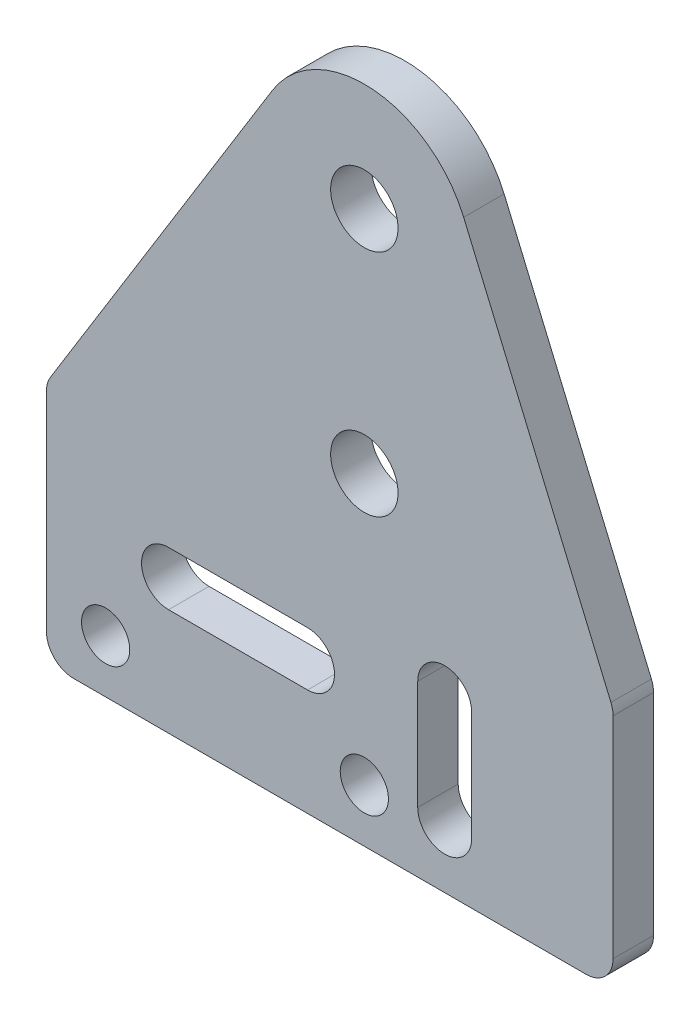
ISO-10303-21;
HEADER;
FILE_DESCRIPTION(('STEP AP214'),'2;1');
FILE_NAME('part.step','',(''),(''),'','','');
FILE_SCHEMA(('AUTOMOTIVE_DESIGN { 1 0 10303 214 1 1 1 1 }'));
ENDSEC;
DATA;
#1=APPLICATION_CONTEXT('core data for automotive mechanical design processes');
#2=APPLICATION_PROTOCOL_DEFINITION('international standard','automotive_design',2000,#1);
#3=PRODUCT_CONTEXT('',#1,'mechanical');
#4=PRODUCT('Part','Part','',(#3));
#5=PRODUCT_RELATED_PRODUCT_CATEGORY('part','',(#4));
#6=PRODUCT_DEFINITION_FORMATION('','',#4);
#7=PRODUCT_DEFINITION_CONTEXT('part definition',#1,'design');
#8=PRODUCT_DEFINITION('design','',#6,#7);
#9=PRODUCT_DEFINITION_SHAPE('','',#8);
#10=(LENGTH_UNIT() NAMED_UNIT(*) SI_UNIT(.MILLI.,.METRE.));
#11=(NAMED_UNIT(*) PLANE_ANGLE_UNIT() SI_UNIT($,.RADIAN.));
#12=(NAMED_UNIT(*) SI_UNIT($,.STERADIAN.) SOLID_ANGLE_UNIT());
#13=UNCERTAINTY_MEASURE_WITH_UNIT(LENGTH_MEASURE(1.E-05),#10,'distance_accuracy_value','');
#14=(GEOMETRIC_REPRESENTATION_CONTEXT(3) GLOBAL_UNCERTAINTY_ASSIGNED_CONTEXT((#13)) GLOBAL_UNIT_ASSIGNED_CONTEXT((#10,
#11,#12)) REPRESENTATION_CONTEXT('',''));
#15=CARTESIAN_POINT('',(0.,0.,0.));
#16=DIRECTION('',(0.,0.,1.));
#17=DIRECTION('',(1.,0.,0.));
#18=AXIS2_PLACEMENT_3D('',#15,#16,#17);
#19=CARTESIAN_POINT('',(16.4374999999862,198.39260540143,3.));
#20=DIRECTION('',(0.,0.,-1.));
#21=DIRECTION('',(-1.,0.,0.));
#22=AXIS2_PLACEMENT_3D('',#19,#20,#21);
#23=CYLINDRICAL_SURFACE('',#22,2.);
#24=CARTESIAN_POINT('',(16.4374999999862,198.39260540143,0.));
#25=DIRECTION('',(0.,0.,-1.));
#26=DIRECTION('',(-1.,0.,0.));
#27=AXIS2_PLACEMENT_3D('',#24,#25,#26);
#28=CIRCLE('',#27,2.);
#29=CARTESIAN_POINT('',(18.4374999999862,198.39260540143,0.));
#30=VERTEX_POINT('',#29);
#31=CARTESIAN_POINT('',(18.2781418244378,199.1749337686,0.));
#32=VERTEX_POINT('',#31);
#33=EDGE_CURVE('E156',#30,#32,#28,.F.);
#34=ORIENTED_EDGE('',*,*,#33,.T.);
#35=DIRECTION('',(0.,0.,1.));
#36=VECTOR('',#35,1.);
#37=CARTESIAN_POINT('',(18.2781418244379,199.1749337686,3.));
#38=LINE('',#37,#36);
#39=CARTESIAN_POINT('',(18.2781418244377,199.1749337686,3.));
#40=VERTEX_POINT('',#39);
#41=EDGE_CURVE('E146',#32,#40,#38,.T.);
#42=ORIENTED_EDGE('',*,*,#41,.T.);
#43=CARTESIAN_POINT('',(16.4374999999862,198.39260540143,3.));
#44=DIRECTION('',(0.,0.,-1.));
#45=DIRECTION('',(-1.,0.,0.));
#46=AXIS2_PLACEMENT_3D('',#43,#44,#45);
#47=CIRCLE('',#46,2.);
#48=CARTESIAN_POINT('',(18.4374999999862,198.39260540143,3.));
#49=VERTEX_POINT('',#48);
#50=EDGE_CURVE('E20',#40,#49,#47,.T.);
#51=ORIENTED_EDGE('',*,*,#50,.T.);
#52=DIRECTION('',(0.,0.,1.));
#53=VECTOR('',#52,1.);
#54=CARTESIAN_POINT('',(18.4374999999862,198.39260540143,3.));
#55=LINE('',#54,#53);
#56=EDGE_CURVE('E143',#49,#30,#55,.F.);
#57=ORIENTED_EDGE('',*,*,#56,.T.);
#58=EDGE_LOOP('',(#34,#42,#51,#57));
#59=FACE_BOUND('',#58,.T.);
#60=ADVANCED_FACE('F17',(#59),#23,.T.);
#61=CARTESIAN_POINT('',(-21.5625000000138,198.232188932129,3.));
#62=DIRECTION('',(0.,0.,-1.));
#63=DIRECTION('',(-1.,0.,0.));
#64=AXIS2_PLACEMENT_3D('',#61,#62,#63);
#65=CYLINDRICAL_SURFACE('',#64,2.);
#66=CARTESIAN_POINT('',(-21.5625000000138,198.232188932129,0.));
#67=DIRECTION('',(0.,0.,-1.));
#68=DIRECTION('',(-1.,0.,0.));
#69=AXIS2_PLACEMENT_3D('',#66,#67,#68);
#70=CIRCLE('',#69,2.);
#71=CARTESIAN_POINT('',(-23.2641391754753,199.283104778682,0.));
#72=VERTEX_POINT('',#71);
#73=CARTESIAN_POINT('',(-23.5625000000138,198.232188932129,0.));
#74=VERTEX_POINT('',#73);
#75=EDGE_CURVE('E292',#72,#74,#70,.F.);
#76=ORIENTED_EDGE('',*,*,#75,.T.);
#77=DIRECTION('',(0.,0.,-1.));
#78=VECTOR('',#77,1.);
#79=CARTESIAN_POINT('',(-23.5625000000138,198.232188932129,3.));
#80=LINE('',#79,#78);
#81=CARTESIAN_POINT('',(-23.5625000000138,198.232188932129,3.));
#82=VERTEX_POINT('',#81);
#83=EDGE_CURVE('E210',#74,#82,#80,.F.);
#84=ORIENTED_EDGE('',*,*,#83,.T.);
#85=CARTESIAN_POINT('',(-21.5625000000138,198.232188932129,3.));
#86=DIRECTION('',(0.,0.,-1.));
#87=DIRECTION('',(-1.,0.,0.));
#88=AXIS2_PLACEMENT_3D('',#85,#86,#87);
#89=CIRCLE('',#88,2.);
#90=CARTESIAN_POINT('',(-23.2641391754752,199.283104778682,3.));
#91=VERTEX_POINT('',#90);
#92=EDGE_CURVE('E148',#82,#91,#89,.T.);
#93=ORIENTED_EDGE('',*,*,#92,.T.);
#94=DIRECTION('',(0.,0.,1.));
#95=VECTOR('',#94,1.);
#96=CARTESIAN_POINT('',(-23.2641391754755,199.283104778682,3.));
#97=LINE('',#96,#95);
#98=EDGE_CURVE('E216',#91,#72,#97,.F.);
#99=ORIENTED_EDGE('',*,*,#98,.T.);
#100=EDGE_LOOP('',(#76,#84,#93,#99));
#101=FACE_BOUND('',#100,.T.);
#102=ADVANCED_FACE('F295',(#101),#65,.T.);
#103=CARTESIAN_POINT('',(0.,221.727500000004,0.));
#104=DIRECTION('',(0.,0.,1.));
#105=DIRECTION('',(1.,0.,0.));
#106=AXIS2_PLACEMENT_3D('',#103,#104,#105);
#107=PLANE('',#106);
#108=DIRECTION('',(1.,0.,0.));
#109=VECTOR('',#108,1.);
#110=CARTESIAN_POINT('',(0.,188.730000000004,0.));
#111=LINE('',#110,#109);
#112=CARTESIAN_POINT('',(-4.21250000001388,188.730000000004,0.));
#113=VERTEX_POINT('',#112);
#114=CARTESIAN_POINT('',(-14.5125000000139,188.730000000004,0.));
#115=VERTEX_POINT('',#114);
#116=EDGE_CURVE('E181',#113,#115,#111,.F.);
#117=ORIENTED_EDGE('',*,*,#116,.F.);
#118=CARTESIAN_POINT('',(-4.21250000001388,190.730000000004,0.));
#119=DIRECTION('',(0.,0.,1.));
#120=DIRECTION('',(1.,0.,0.));
#121=AXIS2_PLACEMENT_3D('',#118,#119,#120);
#122=CIRCLE('',#121,2.);
#123=CARTESIAN_POINT('',(-4.21250000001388,192.730000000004,0.));
#124=VERTEX_POINT('',#123);
#125=EDGE_CURVE('E164',#113,#124,#122,.T.);
#126=ORIENTED_EDGE('',*,*,#125,.T.);
#127=DIRECTION('',(1.,0.,0.));
#128=VECTOR('',#127,1.);
#129=CARTESIAN_POINT('',(0.,192.730000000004,0.));
#130=LINE('',#129,#128);
#131=CARTESIAN_POINT('',(-14.5125000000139,192.730000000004,0.));
#132=VERTEX_POINT('',#131);
#133=EDGE_CURVE('E177',#124,#132,#130,.F.);
#134=ORIENTED_EDGE('',*,*,#133,.T.);
#135=CARTESIAN_POINT('',(-14.5125000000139,190.730000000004,0.));
#136=DIRECTION('',(0.,0.,1.));
#137=DIRECTION('',(1.,0.,0.));
#138=AXIS2_PLACEMENT_3D('',#135,#136,#137);
#139=CIRCLE('',#138,2.);
#140=EDGE_CURVE('E180',#132,#115,#139,.T.);
#141=ORIENTED_EDGE('',*,*,#140,.T.);
#142=EDGE_LOOP('',(#117,#126,#134,#141));
#143=FACE_BOUND('',#142,.T.);
#144=CARTESIAN_POINT('',(0.,204.727500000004,0.));
#145=DIRECTION('',(0.,0.,-1.));
#146=DIRECTION('',(-1.,0.,0.));
#147=AXIS2_PLACEMENT_3D('',#144,#145,#146);
#148=CIRCLE('',#147,2.5);
#149=CARTESIAN_POINT('',(-2.5,204.727500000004,0.));
#150=VERTEX_POINT('',#149);
#151=EDGE_CURVE('E227',#150,#150,#148,.F.);
#152=ORIENTED_EDGE('',*,*,#151,.T.);
#153=EDGE_LOOP('',(#152));
#154=FACE_BOUND('',#153,.T.);
#155=CARTESIAN_POINT('',(0.,221.727500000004,0.));
#156=DIRECTION('',(0.,0.,-1.));
#157=DIRECTION('',(-1.,0.,0.));
#158=AXIS2_PLACEMENT_3D('',#155,#156,#157);
#159=CIRCLE('',#158,2.5);
#160=CARTESIAN_POINT('',(-2.5,221.727500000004,0.));
#161=VERTEX_POINT('',#160);
#162=EDGE_CURVE('E197',#161,#161,#159,.F.);
#163=ORIENTED_EDGE('',*,*,#162,.T.);
#164=EDGE_LOOP('',(#163));
#165=FACE_BOUND('',#164,.T.);
#166=CARTESIAN_POINT('',(-1.38487311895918E-11,184.727500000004,0.));
#167=DIRECTION('',(0.,0.,-1.));
#168=DIRECTION('',(-1.,0.,0.));
#169=AXIS2_PLACEMENT_3D('',#166,#167,#168);
#170=CIRCLE('',#169,1.7875);
#171=CARTESIAN_POINT('',(-1.78750000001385,184.727500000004,0.));
#172=VERTEX_POINT('',#171);
#173=EDGE_CURVE('E279',#172,#172,#170,.F.);
#174=ORIENTED_EDGE('',*,*,#173,.T.);
#175=EDGE_LOOP('',(#174));
#176=FACE_BOUND('',#175,.T.);
#177=CARTESIAN_POINT('',(-19.1750000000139,184.727500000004,0.));
#178=DIRECTION('',(0.,0.,-1.));
#179=DIRECTION('',(-1.,0.,0.));
#180=AXIS2_PLACEMENT_3D('',#177,#178,#179);
#181=CIRCLE('',#180,1.7875);
#182=CARTESIAN_POINT('',(-20.9625000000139,184.727500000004,0.));
#183=VERTEX_POINT('',#182);
#184=EDGE_CURVE('E282',#183,#183,#181,.F.);
#185=ORIENTED_EDGE('',*,*,#184,.T.);
#186=EDGE_LOOP('',(#185));
#187=FACE_BOUND('',#186,.T.);
#188=DIRECTION('',(0.,1.,0.));
#189=VECTOR('',#188,1.);
#190=CARTESIAN_POINT('',(3.95749999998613,0.,0.));
#191=LINE('',#190,#189);
#192=CARTESIAN_POINT('',(3.95749999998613,185.275000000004,0.));
#193=VERTEX_POINT('',#192);
#194=CARTESIAN_POINT('',(3.95749999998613,193.375000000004,0.));
#195=VERTEX_POINT('',#194);
#196=EDGE_CURVE('E194',#193,#195,#191,.T.);
#197=ORIENTED_EDGE('',*,*,#196,.F.);
#198=CARTESIAN_POINT('',(5.95749999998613,185.275000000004,0.));
#199=DIRECTION('',(0.,0.,1.));
#200=DIRECTION('',(1.,0.,0.));
#201=AXIS2_PLACEMENT_3D('',#198,#199,#200);
#202=CIRCLE('',#201,2.);
#203=CARTESIAN_POINT('',(7.95749999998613,185.275000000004,0.));
#204=VERTEX_POINT('',#203);
#205=EDGE_CURVE('E188',#193,#204,#202,.T.);
#206=ORIENTED_EDGE('',*,*,#205,.T.);
#207=DIRECTION('',(0.,1.,0.));
#208=VECTOR('',#207,1.);
#209=CARTESIAN_POINT('',(7.95749999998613,0.,0.));
#210=LINE('',#209,#208);
#211=CARTESIAN_POINT('',(7.95749999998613,193.375000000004,0.));
#212=VERTEX_POINT('',#211);
#213=EDGE_CURVE('E190',#204,#212,#210,.T.);
#214=ORIENTED_EDGE('',*,*,#213,.T.);
#215=CARTESIAN_POINT('',(5.95749999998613,193.375000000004,0.));
#216=DIRECTION('',(0.,0.,1.));
#217=DIRECTION('',(1.,0.,0.));
#218=AXIS2_PLACEMENT_3D('',#215,#216,#217);
#219=CIRCLE('',#218,2.);
#220=EDGE_CURVE('E193',#212,#195,#219,.T.);
#221=ORIENTED_EDGE('',*,*,#220,.T.);
#222=EDGE_LOOP('',(#197,#206,#214,#221));
#223=FACE_BOUND('',#222,.T.);
#224=ORIENTED_EDGE('',*,*,#33,.F.);
#225=DIRECTION('',(0.,1.,0.));
#226=VECTOR('',#225,1.);
#227=CARTESIAN_POINT('',(18.4374999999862,198.800000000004,0.));
#228=LINE('',#227,#226);
#229=CARTESIAN_POINT('',(18.4374999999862,182.800000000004,0.));
#230=VERTEX_POINT('',#229);
#231=EDGE_CURVE('E155',#30,#230,#228,.F.);
#232=ORIENTED_EDGE('',*,*,#231,.T.);
#233=CARTESIAN_POINT('',(16.4374999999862,182.800000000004,0.));
#234=DIRECTION('',(0.,0.,-1.));
#235=DIRECTION('',(-1.,0.,0.));
#236=AXIS2_PLACEMENT_3D('',#233,#234,#235);
#237=CIRCLE('',#236,2.);
#238=CARTESIAN_POINT('',(16.4374999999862,180.800000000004,0.));
#239=VERTEX_POINT('',#238);
#240=EDGE_CURVE('E198',#239,#230,#237,.F.);
#241=ORIENTED_EDGE('',*,*,#240,.F.);
#242=DIRECTION('',(1.,0.,0.));
#243=VECTOR('',#242,1.);
#244=CARTESIAN_POINT('',(-23.5625000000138,180.800000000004,0.));
#245=LINE('',#244,#243);
#246=CARTESIAN_POINT('',(-21.5625000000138,180.800000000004,0.));
#247=VERTEX_POINT('',#246);
#248=EDGE_CURVE('E202',#239,#247,#245,.F.);
#249=ORIENTED_EDGE('',*,*,#248,.T.);
#250=CARTESIAN_POINT('',(-21.5625000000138,182.800000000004,0.));
#251=DIRECTION('',(0.,0.,-1.));
#252=DIRECTION('',(-1.,0.,0.));
#253=AXIS2_PLACEMENT_3D('',#250,#251,#252);
#254=CIRCLE('',#253,2.);
#255=CARTESIAN_POINT('',(-23.5625000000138,182.800000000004,0.));
#256=VERTEX_POINT('',#255);
#257=EDGE_CURVE('E205',#256,#247,#254,.F.);
#258=ORIENTED_EDGE('',*,*,#257,.F.);
#259=DIRECTION('',(0.,1.,0.));
#260=VECTOR('',#259,1.);
#261=CARTESIAN_POINT('',(-23.5625000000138,198.800000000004,0.));
#262=LINE('',#261,#260);
#263=EDGE_CURVE('E209',#256,#74,#262,.T.);
#264=ORIENTED_EDGE('',*,*,#263,.T.);
#265=ORIENTED_EDGE('',*,*,#75,.F.);
#266=DIRECTION('',(0.525457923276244,0.850819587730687,0.));
#267=VECTOR('',#266,1.);
#268=CARTESIAN_POINT('',(-6.80655670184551,225.931163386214,0.));
#269=LINE('',#268,#267);
#270=CARTESIAN_POINT('',(-6.80655670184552,225.931163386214,0.));
#271=VERTEX_POINT('',#270);
#272=EDGE_CURVE('E213',#72,#271,#269,.T.);
#273=ORIENTED_EDGE('',*,*,#272,.T.);
#274=CARTESIAN_POINT('',(0.,221.727500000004,0.));
#275=DIRECTION('',(0.,0.,-1.));
#276=DIRECTION('',(-1.,0.,0.));
#277=AXIS2_PLACEMENT_3D('',#274,#275,#276);
#278=CIRCLE('',#277,8.);
#279=CARTESIAN_POINT('',(7.36256729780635,224.856813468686,0.));
#280=VERTEX_POINT('',#279);
#281=EDGE_CURVE('E221',#280,#271,#278,.F.);
#282=ORIENTED_EDGE('',*,*,#281,.F.);
#283=DIRECTION('',(0.391164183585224,-0.920320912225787,0.));
#284=VECTOR('',#283,1.);
#285=CARTESIAN_POINT('',(18.4374999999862,198.800000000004,0.));
#286=LINE('',#285,#284);
#287=EDGE_CURVE('E222',#280,#32,#286,.T.);
#288=ORIENTED_EDGE('',*,*,#287,.T.);
#289=EDGE_LOOP('',(#224,#232,#241,#249,#258,#264,#265,#273,#282,#288));
#290=FACE_BOUND('',#289,.T.);
#291=ADVANCED_FACE('F328',(#143,#154,#165,#176,#187,#223,#290),#107,.F.);
#292=CARTESIAN_POINT('',(18.4374999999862,198.800000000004,3.));
#293=DIRECTION('',(-1.,0.,0.));
#294=DIRECTION('',(0.,0.,1.));
#295=AXIS2_PLACEMENT_3D('',#292,#293,#294);
#296=PLANE('',#295);
#297=ORIENTED_EDGE('',*,*,#56,.F.);
#298=DIRECTION('',(0.,1.,0.));
#299=VECTOR('',#298,1.);
#300=CARTESIAN_POINT('',(18.4374999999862,221.727500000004,3.));
#301=LINE('',#300,#299);
#302=CARTESIAN_POINT('',(18.4374999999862,182.800000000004,3.));
#303=VERTEX_POINT('',#302);
#304=EDGE_CURVE('E153',#303,#49,#301,.T.);
#305=ORIENTED_EDGE('',*,*,#304,.F.);
#306=DIRECTION('',(0.,0.,-1.));
#307=VECTOR('',#306,1.);
#308=CARTESIAN_POINT('',(18.4374999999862,182.800000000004,3.));
#309=LINE('',#308,#307);
#310=EDGE_CURVE('E195',#230,#303,#309,.F.);
#311=ORIENTED_EDGE('',*,*,#310,.F.);
#312=ORIENTED_EDGE('',*,*,#231,.F.);
#313=EDGE_LOOP('',(#297,#305,#311,#312));
#314=FACE_BOUND('',#313,.T.);
#315=ADVANCED_FACE('F151',(#314),#296,.F.);
#316=CARTESIAN_POINT('',(18.4374999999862,198.800000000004,3.));
#317=DIRECTION('',(-0.920320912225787,-0.391164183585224,0.));
#318=DIRECTION('',(0.391164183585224,-0.920320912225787,0.));
#319=AXIS2_PLACEMENT_3D('',#316,#317,#318);
#320=PLANE('',#319);
#321=ORIENTED_EDGE('',*,*,#41,.F.);
#322=ORIENTED_EDGE('',*,*,#287,.F.);
#323=DIRECTION('',(0.,0.,-1.));
#324=VECTOR('',#323,1.);
#325=CARTESIAN_POINT('',(7.36256729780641,224.856813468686,3.));
#326=LINE('',#325,#324);
#327=CARTESIAN_POINT('',(7.36256729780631,224.856813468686,3.));
#328=VERTEX_POINT('',#327);
#329=EDGE_CURVE('E217',#328,#280,#326,.T.);
#330=ORIENTED_EDGE('',*,*,#329,.F.);
#331=DIRECTION('',(-0.391164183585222,0.920320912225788,0.));
#332=VECTOR('',#331,1.);
#333=CARTESIAN_POINT('',(18.2781418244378,199.174933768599,3.));
#334=LINE('',#333,#332);
#335=EDGE_CURVE('E163',#40,#328,#334,.T.);
#336=ORIENTED_EDGE('',*,*,#335,.F.);
#337=EDGE_LOOP('',(#321,#322,#330,#336));
#338=FACE_BOUND('',#337,.T.);
#339=ADVANCED_FACE('F506',(#338),#320,.F.);
#340=CARTESIAN_POINT('',(0.,221.727500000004,3.));
#341=DIRECTION('',(0.,0.,-1.));
#342=DIRECTION('',(-1.,0.,0.));
#343=AXIS2_PLACEMENT_3D('',#340,#341,#342);
#344=CYLINDRICAL_SURFACE('',#343,8.);
#345=CARTESIAN_POINT('',(0.,221.727500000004,3.));
#346=DIRECTION('',(0.,0.,-1.));
#347=DIRECTION('',(-1.,0.,0.));
#348=AXIS2_PLACEMENT_3D('',#345,#346,#347);
#349=CIRCLE('',#348,8.);
#350=CARTESIAN_POINT('',(-6.80655670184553,225.931163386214,3.));
#351=VERTEX_POINT('',#350);
#352=EDGE_CURVE('E166',#328,#351,#349,.F.);
#353=ORIENTED_EDGE('',*,*,#352,.F.);
#354=ORIENTED_EDGE('',*,*,#329,.T.);
#355=ORIENTED_EDGE('',*,*,#281,.T.);
#356=DIRECTION('',(0.,0.,1.));
#357=VECTOR('',#356,1.);
#358=CARTESIAN_POINT('',(-6.80655670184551,225.931163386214,3.));
#359=LINE('',#358,#357);
#360=EDGE_CURVE('E214',#271,#351,#359,.T.);
#361=ORIENTED_EDGE('',*,*,#360,.T.);
#362=EDGE_LOOP('',(#353,#354,#355,#361));
#363=FACE_BOUND('',#362,.T.);
#364=ADVANCED_FACE('F498',(#363),#344,.T.);
#365=CARTESIAN_POINT('',(-6.80655670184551,225.931163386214,3.));
#366=DIRECTION('',(0.850819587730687,-0.525457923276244,0.));
#367=DIRECTION('',(0.525457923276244,0.850819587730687,0.));
#368=AXIS2_PLACEMENT_3D('',#365,#366,#367);
#369=PLANE('',#368);
#370=ORIENTED_EDGE('',*,*,#98,.F.);
#371=DIRECTION('',(-0.525457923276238,-0.850819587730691,0.));
#372=VECTOR('',#371,1.);
#373=CARTESIAN_POINT('',(-6.8065567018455,225.931163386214,3.));
#374=LINE('',#373,#372);
#375=EDGE_CURVE('E269',#351,#91,#374,.T.);
#376=ORIENTED_EDGE('',*,*,#375,.F.);
#377=ORIENTED_EDGE('',*,*,#360,.F.);
#378=ORIENTED_EDGE('',*,*,#272,.F.);
#379=EDGE_LOOP('',(#370,#376,#377,#378));
#380=FACE_BOUND('',#379,.T.);
#381=ADVANCED_FACE('F304',(#380),#369,.F.);
#382=CARTESIAN_POINT('',(-23.5625000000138,198.800000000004,3.));
#383=DIRECTION('',(1.,0.,0.));
#384=DIRECTION('',(0.,0.,-1.));
#385=AXIS2_PLACEMENT_3D('',#382,#383,#384);
#386=PLANE('',#385);
#387=DIRECTION('',(0.,0.,-1.));
#388=VECTOR('',#387,1.);
#389=CARTESIAN_POINT('',(-23.5625000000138,182.800000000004,3.));
#390=LINE('',#389,#388);
#391=CARTESIAN_POINT('',(-23.5625000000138,182.800000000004,3.));
#392=VERTEX_POINT('',#391);
#393=EDGE_CURVE('E206',#392,#256,#390,.T.);
#394=ORIENTED_EDGE('',*,*,#393,.F.);
#395=DIRECTION('',(0.,1.,0.));
#396=VECTOR('',#395,1.);
#397=CARTESIAN_POINT('',(-23.5625000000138,221.727500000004,3.));
#398=LINE('',#397,#396);
#399=EDGE_CURVE('E267',#82,#392,#398,.F.);
#400=ORIENTED_EDGE('',*,*,#399,.F.);
#401=ORIENTED_EDGE('',*,*,#83,.F.);
#402=ORIENTED_EDGE('',*,*,#263,.F.);
#403=EDGE_LOOP('',(#394,#400,#401,#402));
#404=FACE_BOUND('',#403,.T.);
#405=ADVANCED_FACE('F481',(#404),#386,.F.);
#406=CARTESIAN_POINT('',(-21.5625000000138,182.800000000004,3.));
#407=DIRECTION('',(0.,0.,-1.));
#408=DIRECTION('',(-1.,0.,0.));
#409=AXIS2_PLACEMENT_3D('',#406,#407,#408);
#410=CYLINDRICAL_SURFACE('',#409,2.);
#411=ORIENTED_EDGE('',*,*,#257,.T.);
#412=DIRECTION('',(0.,0.,1.));
#413=VECTOR('',#412,1.);
#414=CARTESIAN_POINT('',(-21.5625000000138,180.800000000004,3.));
#415=LINE('',#414,#413);
#416=CARTESIAN_POINT('',(-21.5625000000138,180.800000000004,3.));
#417=VERTEX_POINT('',#416);
#418=EDGE_CURVE('E203',#247,#417,#415,.T.);
#419=ORIENTED_EDGE('',*,*,#418,.T.);
#420=CARTESIAN_POINT('',(-21.5625000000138,182.800000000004,3.));
#421=DIRECTION('',(0.,0.,-1.));
#422=DIRECTION('',(-1.,0.,0.));
#423=AXIS2_PLACEMENT_3D('',#420,#421,#422);
#424=CIRCLE('',#423,2.);
#425=EDGE_CURVE('E264',#392,#417,#424,.F.);
#426=ORIENTED_EDGE('',*,*,#425,.F.);
#427=ORIENTED_EDGE('',*,*,#393,.T.);
#428=EDGE_LOOP('',(#411,#419,#426,#427));
#429=FACE_BOUND('',#428,.T.);
#430=ADVANCED_FACE('F472',(#429),#410,.T.);
#431=CARTESIAN_POINT('',(-23.5625000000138,180.800000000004,3.));
#432=DIRECTION('',(0.,1.,0.));
#433=DIRECTION('',(0.,0.,1.));
#434=AXIS2_PLACEMENT_3D('',#431,#432,#433);
#435=PLANE('',#434);
#436=DIRECTION('',(0.,0.,-1.));
#437=VECTOR('',#436,1.);
#438=CARTESIAN_POINT('',(16.4374999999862,180.800000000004,3.));
#439=LINE('',#438,#437);
#440=CARTESIAN_POINT('',(16.4374999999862,180.800000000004,3.));
#441=VERTEX_POINT('',#440);
#442=EDGE_CURVE('E199',#441,#239,#439,.T.);
#443=ORIENTED_EDGE('',*,*,#442,.F.);
#444=DIRECTION('',(1.,0.,0.));
#445=VECTOR('',#444,1.);
#446=CARTESIAN_POINT('',(0.,180.800000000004,3.));
#447=LINE('',#446,#445);
#448=EDGE_CURVE('E263',#417,#441,#447,.T.);
#449=ORIENTED_EDGE('',*,*,#448,.F.);
#450=ORIENTED_EDGE('',*,*,#418,.F.);
#451=ORIENTED_EDGE('',*,*,#248,.F.);
#452=EDGE_LOOP('',(#443,#449,#450,#451));
#453=FACE_BOUND('',#452,.T.);
#454=ADVANCED_FACE('F463',(#453),#435,.F.);
#455=CARTESIAN_POINT('',(16.4374999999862,182.800000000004,3.));
#456=DIRECTION('',(0.,0.,-1.));
#457=DIRECTION('',(-1.,0.,0.));
#458=AXIS2_PLACEMENT_3D('',#455,#456,#457);
#459=CYLINDRICAL_SURFACE('',#458,2.);
#460=ORIENTED_EDGE('',*,*,#240,.T.);
#461=ORIENTED_EDGE('',*,*,#310,.T.);
#462=CARTESIAN_POINT('',(16.4374999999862,182.800000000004,3.));
#463=DIRECTION('',(0.,0.,-1.));
#464=DIRECTION('',(-1.,0.,0.));
#465=AXIS2_PLACEMENT_3D('',#462,#463,#464);
#466=CIRCLE('',#465,2.);
#467=EDGE_CURVE('E162',#441,#303,#466,.F.);
#468=ORIENTED_EDGE('',*,*,#467,.F.);
#469=ORIENTED_EDGE('',*,*,#442,.T.);
#470=EDGE_LOOP('',(#460,#461,#468,#469));
#471=FACE_BOUND('',#470,.T.);
#472=ADVANCED_FACE('F454',(#471),#459,.T.);
#473=CARTESIAN_POINT('',(0.,221.727500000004,3.));
#474=DIRECTION('',(0.,0.,-1.));
#475=DIRECTION('',(-1.,0.,0.));
#476=AXIS2_PLACEMENT_3D('',#473,#474,#475);
#477=CYLINDRICAL_SURFACE('',#476,2.5);
#478=CARTESIAN_POINT('',(0.,221.727500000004,3.));
#479=DIRECTION('',(0.,0.,-1.));
#480=DIRECTION('',(-1.,0.,0.));
#481=AXIS2_PLACEMENT_3D('',#478,#479,#480);
#482=CIRCLE('',#481,2.5);
#483=CARTESIAN_POINT('',(-2.5,221.727500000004,3.));
#484=VERTEX_POINT('',#483);
#485=EDGE_CURVE('E259',#484,#484,#482,.T.);
#486=ORIENTED_EDGE('',*,*,#485,.F.);
#487=EDGE_LOOP('',(#486));
#488=FACE_BOUND('',#487,.T.);
#489=ORIENTED_EDGE('',*,*,#162,.F.);
#490=EDGE_LOOP('',(#489));
#491=FACE_BOUND('',#490,.T.);
#492=ADVANCED_FACE('F445',(#488,#491),#477,.F.);
#493=CARTESIAN_POINT('',(-19.1750000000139,184.727500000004,3.));
#494=DIRECTION('',(0.,0.,-1.));
#495=DIRECTION('',(-1.,0.,0.));
#496=AXIS2_PLACEMENT_3D('',#493,#494,#495);
#497=CYLINDRICAL_SURFACE('',#496,1.7875);
#498=CARTESIAN_POINT('',(-19.1750000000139,184.727500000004,3.));
#499=DIRECTION('',(0.,0.,-1.));
#500=DIRECTION('',(-1.,0.,0.));
#501=AXIS2_PLACEMENT_3D('',#498,#499,#500);
#502=CIRCLE('',#501,1.7875);
#503=CARTESIAN_POINT('',(-20.9625000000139,184.727500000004,3.));
#504=VERTEX_POINT('',#503);
#505=EDGE_CURVE('E256',#504,#504,#502,.T.);
#506=ORIENTED_EDGE('',*,*,#505,.F.);
#507=EDGE_LOOP('',(#506));
#508=FACE_BOUND('',#507,.T.);
#509=ORIENTED_EDGE('',*,*,#184,.F.);
#510=EDGE_LOOP('',(#509));
#511=FACE_BOUND('',#510,.T.);
#512=ADVANCED_FACE('F436',(#508,#511),#497,.F.);
#513=CARTESIAN_POINT('',(-1.38487311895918E-11,184.727500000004,3.));
#514=DIRECTION('',(0.,0.,-1.));
#515=DIRECTION('',(-1.,0.,0.));
#516=AXIS2_PLACEMENT_3D('',#513,#514,#515);
#517=CYLINDRICAL_SURFACE('',#516,1.7875);
#518=CARTESIAN_POINT('',(-1.38487311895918E-11,184.727500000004,3.));
#519=DIRECTION('',(0.,0.,-1.));
#520=DIRECTION('',(-1.,0.,0.));
#521=AXIS2_PLACEMENT_3D('',#518,#519,#520);
#522=CIRCLE('',#521,1.7875);
#523=CARTESIAN_POINT('',(-1.78750000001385,184.727500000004,3.));
#524=VERTEX_POINT('',#523);
#525=EDGE_CURVE('E253',#524,#524,#522,.T.);
#526=ORIENTED_EDGE('',*,*,#525,.F.);
#527=EDGE_LOOP('',(#526));
#528=FACE_BOUND('',#527,.T.);
#529=ORIENTED_EDGE('',*,*,#173,.F.);
#530=EDGE_LOOP('',(#529));
#531=FACE_BOUND('',#530,.T.);
#532=ADVANCED_FACE('F427',(#528,#531),#517,.F.);
#533=CARTESIAN_POINT('',(0.,204.727500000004,3.));
#534=DIRECTION('',(0.,0.,-1.));
#535=DIRECTION('',(-1.,0.,0.));
#536=AXIS2_PLACEMENT_3D('',#533,#534,#535);
#537=CYLINDRICAL_SURFACE('',#536,2.5);
#538=CARTESIAN_POINT('',(0.,204.727500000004,3.));
#539=DIRECTION('',(0.,0.,-1.));
#540=DIRECTION('',(-1.,0.,0.));
#541=AXIS2_PLACEMENT_3D('',#538,#539,#540);
#542=CIRCLE('',#541,2.5);
#543=CARTESIAN_POINT('',(-2.5,204.727500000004,3.));
#544=VERTEX_POINT('',#543);
#545=EDGE_CURVE('E250',#544,#544,#542,.T.);
#546=ORIENTED_EDGE('',*,*,#545,.F.);
#547=EDGE_LOOP('',(#546));
#548=FACE_BOUND('',#547,.T.);
#549=ORIENTED_EDGE('',*,*,#151,.F.);
#550=EDGE_LOOP('',(#549));
#551=FACE_BOUND('',#550,.T.);
#552=ADVANCED_FACE('F418',(#548,#551),#537,.F.);
#553=CARTESIAN_POINT('',(3.95749999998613,0.,-7.));
#554=DIRECTION('',(1.,0.,0.));
#555=DIRECTION('',(0.,0.,-1.));
#556=AXIS2_PLACEMENT_3D('',#553,#554,#555);
#557=PLANE('',#556);
#558=DIRECTION('',(0.,1.,0.));
#559=VECTOR('',#558,1.);
#560=CARTESIAN_POINT('',(3.95749999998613,221.727500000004,3.));
#561=LINE('',#560,#559);
#562=CARTESIAN_POINT('',(3.95749999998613,185.275000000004,3.));
#563=VERTEX_POINT('',#562);
#564=CARTESIAN_POINT('',(3.95749999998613,193.375000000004,3.));
#565=VERTEX_POINT('',#564);
#566=EDGE_CURVE('E249',#563,#565,#561,.T.);
#567=ORIENTED_EDGE('',*,*,#566,.F.);
#568=DIRECTION('',(0.,0.,1.));
#569=VECTOR('',#568,1.);
#570=CARTESIAN_POINT('',(3.95749999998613,185.275000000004,-7.));
#571=LINE('',#570,#569);
#572=EDGE_CURVE('E184',#563,#193,#571,.F.);
#573=ORIENTED_EDGE('',*,*,#572,.T.);
#574=ORIENTED_EDGE('',*,*,#196,.T.);
#575=DIRECTION('',(0.,0.,1.));
#576=VECTOR('',#575,1.);
#577=CARTESIAN_POINT('',(3.95749999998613,193.375000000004,-7.));
#578=LINE('',#577,#576);
#579=EDGE_CURVE('E191',#195,#565,#578,.T.);
#580=ORIENTED_EDGE('',*,*,#579,.T.);
#581=EDGE_LOOP('',(#567,#573,#574,#580));
#582=FACE_BOUND('',#581,.T.);
#583=ADVANCED_FACE('F409',(#582),#557,.T.);
#584=CARTESIAN_POINT('',(5.95749999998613,193.375000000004,-7.));
#585=DIRECTION('',(0.,0.,1.));
#586=DIRECTION('',(1.,0.,0.));
#587=AXIS2_PLACEMENT_3D('',#584,#585,#586);
#588=CYLINDRICAL_SURFACE('',#587,2.);
#589=DIRECTION('',(0.,0.,-1.));
#590=VECTOR('',#589,1.);
#591=CARTESIAN_POINT('',(7.95749999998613,193.375000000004,-7.));
#592=LINE('',#591,#590);
#593=CARTESIAN_POINT('',(7.95749999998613,193.375000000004,3.));
#594=VERTEX_POINT('',#593);
#595=EDGE_CURVE('E185',#212,#594,#592,.F.);
#596=ORIENTED_EDGE('',*,*,#595,.T.);
#597=CARTESIAN_POINT('',(5.95749999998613,193.375000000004,3.));
#598=DIRECTION('',(0.,0.,1.));
#599=DIRECTION('',(1.,0.,0.));
#600=AXIS2_PLACEMENT_3D('',#597,#598,#599);
#601=CIRCLE('',#600,2.);
#602=EDGE_CURVE('E246',#565,#594,#601,.F.);
#603=ORIENTED_EDGE('',*,*,#602,.F.);
#604=ORIENTED_EDGE('',*,*,#579,.F.);
#605=ORIENTED_EDGE('',*,*,#220,.F.);
#606=EDGE_LOOP('',(#596,#603,#604,#605));
#607=FACE_BOUND('',#606,.T.);
#608=ADVANCED_FACE('F400',(#607),#588,.F.);
#609=CARTESIAN_POINT('',(7.95749999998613,0.,-7.));
#610=DIRECTION('',(1.,0.,0.));
#611=DIRECTION('',(0.,0.,-1.));
#612=AXIS2_PLACEMENT_3D('',#609,#610,#611);
#613=PLANE('',#612);
#614=DIRECTION('',(0.,1.,0.));
#615=VECTOR('',#614,1.);
#616=CARTESIAN_POINT('',(7.95749999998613,221.727500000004,3.));
#617=LINE('',#616,#615);
#618=CARTESIAN_POINT('',(7.95749999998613,185.275000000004,3.));
#619=VERTEX_POINT('',#618);
#620=EDGE_CURVE('E245',#594,#619,#617,.F.);
#621=ORIENTED_EDGE('',*,*,#620,.F.);
#622=ORIENTED_EDGE('',*,*,#595,.F.);
#623=ORIENTED_EDGE('',*,*,#213,.F.);
#624=DIRECTION('',(0.,0.,1.));
#625=VECTOR('',#624,1.);
#626=CARTESIAN_POINT('',(7.95749999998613,185.275000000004,-7.));
#627=LINE('',#626,#625);
#628=EDGE_CURVE('E182',#204,#619,#627,.T.);
#629=ORIENTED_EDGE('',*,*,#628,.T.);
#630=EDGE_LOOP('',(#621,#622,#623,#629));
#631=FACE_BOUND('',#630,.T.);
#632=ADVANCED_FACE('F345',(#631),#613,.F.);
#633=CARTESIAN_POINT('',(5.95749999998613,185.275000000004,-7.));
#634=DIRECTION('',(0.,0.,1.));
#635=DIRECTION('',(1.,0.,0.));
#636=AXIS2_PLACEMENT_3D('',#633,#634,#635);
#637=CYLINDRICAL_SURFACE('',#636,2.);
#638=ORIENTED_EDGE('',*,*,#572,.F.);
#639=CARTESIAN_POINT('',(5.95749999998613,185.275000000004,3.));
#640=DIRECTION('',(0.,0.,1.));
#641=DIRECTION('',(1.,0.,0.));
#642=AXIS2_PLACEMENT_3D('',#639,#640,#641);
#643=CIRCLE('',#642,2.);
#644=EDGE_CURVE('E242',#619,#563,#643,.F.);
#645=ORIENTED_EDGE('',*,*,#644,.F.);
#646=ORIENTED_EDGE('',*,*,#628,.F.);
#647=ORIENTED_EDGE('',*,*,#205,.F.);
#648=EDGE_LOOP('',(#638,#645,#646,#647));
#649=FACE_BOUND('',#648,.T.);
#650=ADVANCED_FACE('F337',(#649),#637,.F.);
#651=CARTESIAN_POINT('',(0.,188.730000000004,-7.));
#652=DIRECTION('',(0.,1.,0.));
#653=DIRECTION('',(0.,0.,1.));
#654=AXIS2_PLACEMENT_3D('',#651,#652,#653);
#655=PLANE('',#654);
#656=DIRECTION('',(1.,0.,0.));
#657=VECTOR('',#656,1.);
#658=CARTESIAN_POINT('',(0.,188.730000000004,3.));
#659=LINE('',#658,#657);
#660=CARTESIAN_POINT('',(-4.21250000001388,188.730000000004,3.));
#661=VERTEX_POINT('',#660);
#662=CARTESIAN_POINT('',(-14.5125000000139,188.730000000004,3.));
#663=VERTEX_POINT('',#662);
#664=EDGE_CURVE('E241',#661,#663,#659,.F.);
#665=ORIENTED_EDGE('',*,*,#664,.F.);
#666=DIRECTION('',(0.,0.,1.));
#667=VECTOR('',#666,1.);
#668=CARTESIAN_POINT('',(-4.21250000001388,188.730000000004,-7.));
#669=LINE('',#668,#667);
#670=EDGE_CURVE('E168',#661,#113,#669,.F.);
#671=ORIENTED_EDGE('',*,*,#670,.T.);
#672=ORIENTED_EDGE('',*,*,#116,.T.);
#673=DIRECTION('',(0.,0.,1.));
#674=VECTOR('',#673,1.);
#675=CARTESIAN_POINT('',(-14.5125000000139,188.730000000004,-7.));
#676=LINE('',#675,#674);
#677=EDGE_CURVE('E178',#115,#663,#676,.T.);
#678=ORIENTED_EDGE('',*,*,#677,.T.);
#679=EDGE_LOOP('',(#665,#671,#672,#678));
#680=FACE_BOUND('',#679,.T.);
#681=ADVANCED_FACE('F335',(#680),#655,.T.);
#682=CARTESIAN_POINT('',(-14.5125000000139,190.730000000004,-7.));
#683=DIRECTION('',(0.,0.,1.));
#684=DIRECTION('',(1.,0.,0.));
#685=AXIS2_PLACEMENT_3D('',#682,#683,#684);
#686=CYLINDRICAL_SURFACE('',#685,2.);
#687=DIRECTION('',(0.,0.,1.));
#688=VECTOR('',#687,1.);
#689=CARTESIAN_POINT('',(-14.5125000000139,192.730000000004,-7.));
#690=LINE('',#689,#688);
#691=CARTESIAN_POINT('',(-14.5125000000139,192.730000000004,3.));
#692=VERTEX_POINT('',#691);
#693=EDGE_CURVE('E175',#132,#692,#690,.T.);
#694=ORIENTED_EDGE('',*,*,#693,.T.);
#695=CARTESIAN_POINT('',(-14.5125000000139,190.730000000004,3.));
#696=DIRECTION('',(0.,0.,1.));
#697=DIRECTION('',(1.,0.,0.));
#698=AXIS2_PLACEMENT_3D('',#695,#696,#697);
#699=CIRCLE('',#698,2.);
#700=EDGE_CURVE('E238',#663,#692,#699,.F.);
#701=ORIENTED_EDGE('',*,*,#700,.F.);
#702=ORIENTED_EDGE('',*,*,#677,.F.);
#703=ORIENTED_EDGE('',*,*,#140,.F.);
#704=EDGE_LOOP('',(#694,#701,#702,#703));
#705=FACE_BOUND('',#704,.T.);
#706=ADVANCED_FACE('F325',(#705),#686,.F.);
#707=CARTESIAN_POINT('',(0.,192.730000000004,-7.));
#708=DIRECTION('',(0.,1.,0.));
#709=DIRECTION('',(0.,0.,1.));
#710=AXIS2_PLACEMENT_3D('',#707,#708,#709);
#711=PLANE('',#710);
#712=DIRECTION('',(1.,0.,0.));
#713=VECTOR('',#712,1.);
#714=CARTESIAN_POINT('',(0.,192.730000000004,3.));
#715=LINE('',#714,#713);
#716=CARTESIAN_POINT('',(-4.21250000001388,192.730000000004,3.));
#717=VERTEX_POINT('',#716);
#718=EDGE_CURVE('E26',#692,#717,#715,.T.);
#719=ORIENTED_EDGE('',*,*,#718,.F.);
#720=ORIENTED_EDGE('',*,*,#693,.F.);
#721=ORIENTED_EDGE('',*,*,#133,.F.);
#722=DIRECTION('',(0.,0.,1.));
#723=VECTOR('',#722,1.);
#724=CARTESIAN_POINT('',(-4.21250000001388,192.730000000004,-7.));
#725=LINE('',#724,#723);
#726=EDGE_CURVE('E35',#124,#717,#725,.T.);
#727=ORIENTED_EDGE('',*,*,#726,.T.);
#728=EDGE_LOOP('',(#719,#720,#721,#727));
#729=FACE_BOUND('',#728,.T.);
#730=ADVANCED_FACE('F322',(#729),#711,.F.);
#731=CARTESIAN_POINT('',(-4.21250000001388,190.730000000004,-7.));
#732=DIRECTION('',(0.,0.,1.));
#733=DIRECTION('',(1.,0.,0.));
#734=AXIS2_PLACEMENT_3D('',#731,#732,#733);
#735=CYLINDRICAL_SURFACE('',#734,2.);
#736=ORIENTED_EDGE('',*,*,#125,.F.);
#737=ORIENTED_EDGE('',*,*,#670,.F.);
#738=CARTESIAN_POINT('',(-4.21250000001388,190.730000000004,3.));
#739=DIRECTION('',(0.,0.,1.));
#740=DIRECTION('',(1.,0.,0.));
#741=AXIS2_PLACEMENT_3D('',#738,#739,#740);
#742=CIRCLE('',#741,2.);
#743=EDGE_CURVE('E11',#717,#661,#742,.F.);
#744=ORIENTED_EDGE('',*,*,#743,.F.);
#745=ORIENTED_EDGE('',*,*,#726,.F.);
#746=EDGE_LOOP('',(#736,#737,#744,#745));
#747=FACE_BOUND('',#746,.T.);
#748=ADVANCED_FACE('F333',(#747),#735,.F.);
#749=CARTESIAN_POINT('',(0.,221.727500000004,3.));
#750=DIRECTION('',(0.,0.,1.));
#751=DIRECTION('',(1.,0.,0.));
#752=AXIS2_PLACEMENT_3D('',#749,#750,#751);
#753=PLANE('',#752);
#754=ORIENTED_EDGE('',*,*,#743,.T.);
#755=ORIENTED_EDGE('',*,*,#664,.T.);
#756=ORIENTED_EDGE('',*,*,#700,.T.);
#757=ORIENTED_EDGE('',*,*,#718,.T.);
#758=EDGE_LOOP('',(#754,#755,#756,#757));
#759=FACE_BOUND('',#758,.T.);
#760=ORIENTED_EDGE('',*,*,#620,.T.);
#761=ORIENTED_EDGE('',*,*,#644,.T.);
#762=ORIENTED_EDGE('',*,*,#566,.T.);
#763=ORIENTED_EDGE('',*,*,#602,.T.);
#764=EDGE_LOOP('',(#760,#761,#762,#763));
#765=FACE_BOUND('',#764,.T.);
#766=ORIENTED_EDGE('',*,*,#545,.T.);
#767=EDGE_LOOP('',(#766));
#768=FACE_BOUND('',#767,.T.);
#769=ORIENTED_EDGE('',*,*,#525,.T.);
#770=EDGE_LOOP('',(#769));
#771=FACE_BOUND('',#770,.T.);
#772=ORIENTED_EDGE('',*,*,#505,.T.);
#773=EDGE_LOOP('',(#772));
#774=FACE_BOUND('',#773,.T.);
#775=ORIENTED_EDGE('',*,*,#485,.T.);
#776=EDGE_LOOP('',(#775));
#777=FACE_BOUND('',#776,.T.);
#778=ORIENTED_EDGE('',*,*,#448,.T.);
#779=ORIENTED_EDGE('',*,*,#467,.T.);
#780=ORIENTED_EDGE('',*,*,#304,.T.);
#781=ORIENTED_EDGE('',*,*,#50,.F.);
#782=ORIENTED_EDGE('',*,*,#335,.T.);
#783=ORIENTED_EDGE('',*,*,#352,.T.);
#784=ORIENTED_EDGE('',*,*,#375,.T.);
#785=ORIENTED_EDGE('',*,*,#92,.F.);
#786=ORIENTED_EDGE('',*,*,#399,.T.);
#787=ORIENTED_EDGE('',*,*,#425,.T.);
#788=EDGE_LOOP('',(#778,#779,#780,#781,#782,#783,#784,#785,#786,#787));
#789=FACE_BOUND('',#788,.T.);
#790=ADVANCED_FACE('F160',(#759,#765,#768,#771,#774,#777,#789),#753,.T.);
#791=CLOSED_SHELL('',(#60,#102,#291,#315,#339,#364,#381,#405,#430,#454,#472,#492,#512,#532,#552,
#583,#608,#632,#650,#681,#706,#730,#748,#790));
#792=MANIFOLD_SOLID_BREP('B1',#791);
#793=ADVANCED_BREP_SHAPE_REPRESENTATION('',(#18,#792),#14);
#794=SHAPE_DEFINITION_REPRESENTATION(#9,#793);
ENDSEC;
END-ISO-10303-21;
